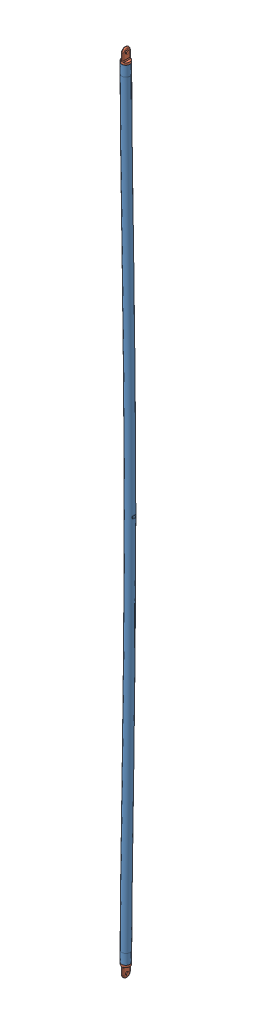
SolidWorks assembly Stange+Gelenk_780-380.sldasm, configuration Standard (file format 5000). Lengths in mm.
Overall size (12.14 785.91 8).
3 component instances, 2 part files, 6 mates.
Components (placement in the parent):
- Stange-1: Stange.SLDPRT [760x8mm-B380] at (-4 -380 0) size (12.14 760 8)
- Endstift-1: Endstift.SLDPRT [Standard] at (-4 380 0) size (7.8 22.96 7.8)
- Endstift-2: Endstift.SLDPRT [Standard] at (-4 -380 0) x (1 0 0) z (0 0 -1) size (7.8 22.96 7.8)
Mates (geometry in assembly coordinates):
- Konzentrisch11: concentric aligned: cylinder of Stange-1 through (-4 370 0) axis (0 1 0) radius 3; cylinder of Endstift-1 through (-4 370 0) axis (0 1 0) radius 3
- Deckungsgleich11: coincident anti-aligned: plane of Stange-1 through (-4 380 0) normal (0 1 0); plane of Endstift-1 through (-4 380 0) normal (0 -1 0)
- Konzentrisch21: concentric aligned: cylinder of Stange-1 through (-4 -370 0) axis (0 -1 0) radius 3; cylinder of Endstift-2 through (-4 -370 0) axis (0 -1 0) radius 3
- Deckungsgleich21: coincident anti-aligned: plane of Stange-1 through (-4 -380 0) normal (0 -1 0); plane of Endstift-2 through (-4 -380 0) normal (0 1 0)
- Parallel2: parallel aligned: plane of Stange-1 through (-4 0 0) normal (-1 0 0); plane of Endstift-1 through (-5 383.0862 -3.901) normal (-1 0 0)
- Parallel3: parallel aligned: plane of Stange-1 through (-4 0 0) normal (-1 0 0); plane of Endstift-2 through (-5 -383.0862 3.901) normal (-1 0 0)
